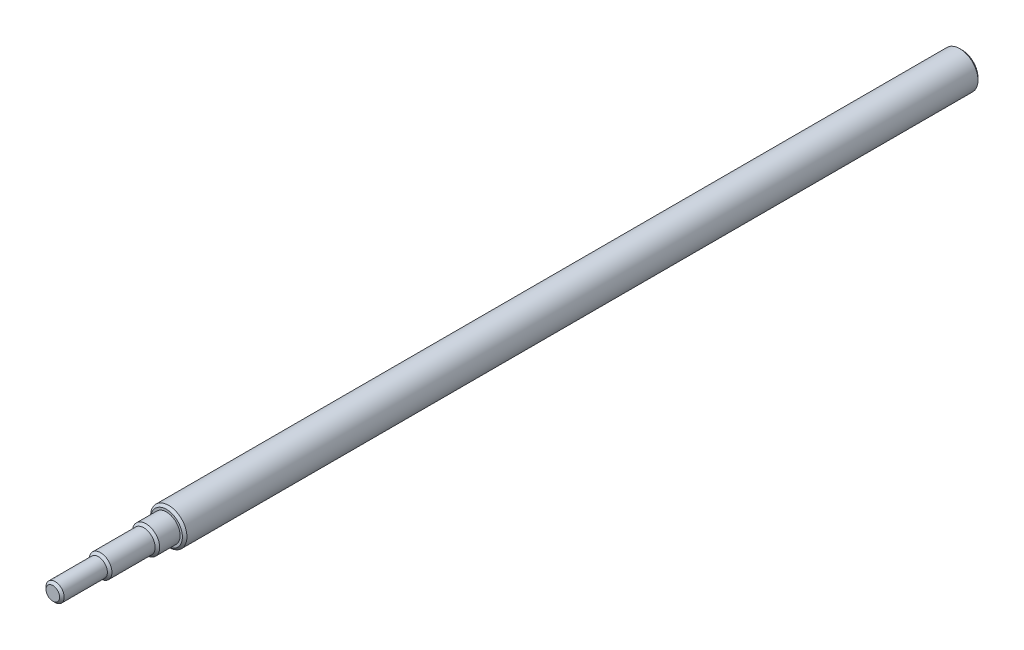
ISO-10303-21;
HEADER;
FILE_DESCRIPTION(('STEP AP214'),'2;1');
FILE_NAME('part.step','',(''),(''),'','','');
FILE_SCHEMA(('AUTOMOTIVE_DESIGN { 1 0 10303 214 1 1 1 1 }'));
ENDSEC;
DATA;
#1=APPLICATION_CONTEXT('core data for automotive mechanical design processes');
#2=APPLICATION_PROTOCOL_DEFINITION('international standard','automotive_design',2000,#1);
#3=PRODUCT_CONTEXT('',#1,'mechanical');
#4=PRODUCT('Part','Part','',(#3));
#5=PRODUCT_RELATED_PRODUCT_CATEGORY('part','',(#4));
#6=PRODUCT_DEFINITION_FORMATION('','',#4);
#7=PRODUCT_DEFINITION_CONTEXT('part definition',#1,'design');
#8=PRODUCT_DEFINITION('design','',#6,#7);
#9=PRODUCT_DEFINITION_SHAPE('','',#8);
#10=(LENGTH_UNIT() NAMED_UNIT(*) SI_UNIT(.MILLI.,.METRE.));
#11=(NAMED_UNIT(*) PLANE_ANGLE_UNIT() SI_UNIT($,.RADIAN.));
#12=(NAMED_UNIT(*) SI_UNIT($,.STERADIAN.) SOLID_ANGLE_UNIT());
#13=UNCERTAINTY_MEASURE_WITH_UNIT(LENGTH_MEASURE(1.E-05),#10,'distance_accuracy_value','');
#14=(GEOMETRIC_REPRESENTATION_CONTEXT(3) GLOBAL_UNCERTAINTY_ASSIGNED_CONTEXT((#13)) GLOBAL_UNIT_ASSIGNED_CONTEXT((#10,
#11,#12)) REPRESENTATION_CONTEXT('',''));
#15=CARTESIAN_POINT('',(0.,0.,0.));
#16=DIRECTION('',(0.,0.,1.));
#17=DIRECTION('',(1.,0.,0.));
#18=AXIS2_PLACEMENT_3D('',#15,#16,#17);
#19=CARTESIAN_POINT('',(0.,0.,350.));
#20=DIRECTION('',(0.,0.,-1.));
#21=DIRECTION('',(-1.,0.,0.));
#22=AXIS2_PLACEMENT_3D('',#19,#20,#21);
#23=CYLINDRICAL_SURFACE('',#22,8.);
#24=CARTESIAN_POINT('',(0.,0.,349.));
#25=DIRECTION('',(0.,0.,1.));
#26=DIRECTION('',(1.,0.,0.));
#27=AXIS2_PLACEMENT_3D('',#24,#25,#26);
#28=CIRCLE('',#27,8.);
#29=CARTESIAN_POINT('',(8.,0.,349.));
#30=VERTEX_POINT('',#29);
#31=EDGE_CURVE('E57',#30,#30,#28,.F.);
#32=ORIENTED_EDGE('',*,*,#31,.T.);
#33=EDGE_LOOP('',(#32));
#34=FACE_BOUND('',#33,.T.);
#35=CARTESIAN_POINT('',(0.,0.,0.999999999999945));
#36=DIRECTION('',(0.,0.,1.));
#37=DIRECTION('',(1.,0.,0.));
#38=AXIS2_PLACEMENT_3D('',#35,#36,#37);
#39=CIRCLE('',#38,8.);
#40=CARTESIAN_POINT('',(8.,0.,0.999999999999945));
#41=VERTEX_POINT('',#40);
#42=EDGE_CURVE('E66',#41,#41,#39,.T.);
#43=ORIENTED_EDGE('',*,*,#42,.T.);
#44=EDGE_LOOP('',(#43));
#45=FACE_BOUND('',#44,.T.);
#46=ADVANCED_FACE('F37',(#34,#45),#23,.T.);
#47=CARTESIAN_POINT('',(0.,0.,350.));
#48=DIRECTION('',(0.,0.,1.));
#49=DIRECTION('',(1.,0.,0.));
#50=AXIS2_PLACEMENT_3D('',#47,#48,#49);
#51=PLANE('',#50);
#52=CARTESIAN_POINT('',(0.,0.,350.));
#53=DIRECTION('',(0.,0.,1.));
#54=DIRECTION('',(1.,0.,0.));
#55=AXIS2_PLACEMENT_3D('',#52,#53,#54);
#56=CIRCLE('',#55,7.00000000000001);
#57=CARTESIAN_POINT('',(7.00000000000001,0.,350.));
#58=VERTEX_POINT('',#57);
#59=EDGE_CURVE('E60',#58,#58,#56,.T.);
#60=ORIENTED_EDGE('',*,*,#59,.T.);
#61=EDGE_LOOP('',(#60));
#62=FACE_BOUND('',#61,.T.);
#63=CARTESIAN_POINT('',(0.,0.,350.));
#64=DIRECTION('',(0.,0.,1.));
#65=DIRECTION('',(1.,0.,0.));
#66=AXIS2_PLACEMENT_3D('',#63,#64,#65);
#67=CIRCLE('',#66,6.);
#68=CARTESIAN_POINT('',(6.,0.,350.));
#69=VERTEX_POINT('',#68);
#70=EDGE_CURVE('E69',#69,#69,#67,.T.);
#71=ORIENTED_EDGE('',*,*,#70,.F.);
#72=EDGE_LOOP('',(#71));
#73=FACE_BOUND('',#72,.T.);
#74=ADVANCED_FACE('F94',(#62,#73),#51,.T.);
#75=CARTESIAN_POINT('',(0.,0.,0.));
#76=DIRECTION('',(0.,0.,1.));
#77=DIRECTION('',(1.,0.,0.));
#78=AXIS2_PLACEMENT_3D('',#75,#76,#77);
#79=PLANE('',#78);
#80=CARTESIAN_POINT('',(0.,0.,0.));
#81=DIRECTION('',(0.,0.,1.));
#82=DIRECTION('',(1.,0.,0.));
#83=AXIS2_PLACEMENT_3D('',#80,#81,#82);
#84=CIRCLE('',#83,7.00000000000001);
#85=CARTESIAN_POINT('',(7.00000000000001,0.,0.));
#86=VERTEX_POINT('',#85);
#87=EDGE_CURVE('E63',#86,#86,#84,.F.);
#88=ORIENTED_EDGE('',*,*,#87,.T.);
#89=EDGE_LOOP('',(#88));
#90=FACE_BOUND('',#89,.T.);
#91=ADVANCED_FACE('F100',(#90),#79,.F.);
#92=CARTESIAN_POINT('',(0.,0.,360.));
#93=DIRECTION('',(0.,0.,-1.));
#94=DIRECTION('',(-1.,0.,0.));
#95=AXIS2_PLACEMENT_3D('',#92,#93,#94);
#96=CYLINDRICAL_SURFACE('',#95,6.);
#97=CARTESIAN_POINT('',(0.,0.,359.));
#98=DIRECTION('',(0.,0.,1.));
#99=DIRECTION('',(1.,0.,0.));
#100=AXIS2_PLACEMENT_3D('',#97,#98,#99);
#101=CIRCLE('',#100,6.);
#102=CARTESIAN_POINT('',(6.,0.,359.));
#103=VERTEX_POINT('',#102);
#104=EDGE_CURVE('E10',#103,#103,#101,.F.);
#105=ORIENTED_EDGE('',*,*,#104,.T.);
#106=EDGE_LOOP('',(#105));
#107=FACE_BOUND('',#106,.T.);
#108=ORIENTED_EDGE('',*,*,#70,.T.);
#109=EDGE_LOOP('',(#108));
#110=FACE_BOUND('',#109,.T.);
#111=ADVANCED_FACE('F121',(#107,#110),#96,.T.);
#112=CARTESIAN_POINT('',(0.,0.,380.));
#113=DIRECTION('',(0.,0.,-1.));
#114=DIRECTION('',(-1.,0.,0.));
#115=AXIS2_PLACEMENT_3D('',#112,#113,#114);
#116=CYLINDRICAL_SURFACE('',#115,5.);
#117=CARTESIAN_POINT('',(0.,0.,379.));
#118=DIRECTION('',(0.,0.,1.));
#119=DIRECTION('',(1.,0.,0.));
#120=AXIS2_PLACEMENT_3D('',#117,#118,#119);
#121=CIRCLE('',#120,5.);
#122=CARTESIAN_POINT('',(5.,0.,379.));
#123=VERTEX_POINT('',#122);
#124=EDGE_CURVE('E44',#123,#123,#121,.F.);
#125=ORIENTED_EDGE('',*,*,#124,.T.);
#126=EDGE_LOOP('',(#125));
#127=FACE_BOUND('',#126,.T.);
#128=CARTESIAN_POINT('',(0.,0.,360.));
#129=DIRECTION('',(0.,0.,1.));
#130=DIRECTION('',(1.,0.,0.));
#131=AXIS2_PLACEMENT_3D('',#128,#129,#130);
#132=CIRCLE('',#131,5.);
#133=CARTESIAN_POINT('',(5.,0.,360.));
#134=VERTEX_POINT('',#133);
#135=EDGE_CURVE('E72',#134,#134,#132,.T.);
#136=ORIENTED_EDGE('',*,*,#135,.T.);
#137=EDGE_LOOP('',(#136));
#138=FACE_BOUND('',#137,.T.);
#139=ADVANCED_FACE('F123',(#127,#138),#116,.T.);
#140=CARTESIAN_POINT('',(0.,0.,400.));
#141=DIRECTION('',(0.,0.,-1.));
#142=DIRECTION('',(-1.,0.,0.));
#143=AXIS2_PLACEMENT_3D('',#140,#141,#142);
#144=CYLINDRICAL_SURFACE('',#143,4.);
#145=CARTESIAN_POINT('',(0.,0.,399.));
#146=DIRECTION('',(0.,0.,1.));
#147=DIRECTION('',(1.,0.,0.));
#148=AXIS2_PLACEMENT_3D('',#145,#146,#147);
#149=CIRCLE('',#148,4.);
#150=CARTESIAN_POINT('',(4.,0.,399.));
#151=VERTEX_POINT('',#150);
#152=EDGE_CURVE('E48',#151,#151,#149,.F.);
#153=ORIENTED_EDGE('',*,*,#152,.T.);
#154=EDGE_LOOP('',(#153));
#155=FACE_BOUND('',#154,.T.);
#156=CARTESIAN_POINT('',(0.,0.,380.));
#157=DIRECTION('',(0.,0.,1.));
#158=DIRECTION('',(1.,0.,0.));
#159=AXIS2_PLACEMENT_3D('',#156,#157,#158);
#160=CIRCLE('',#159,4.);
#161=CARTESIAN_POINT('',(4.,0.,380.));
#162=VERTEX_POINT('',#161);
#163=EDGE_CURVE('E75',#162,#162,#160,.T.);
#164=ORIENTED_EDGE('',*,*,#163,.T.);
#165=EDGE_LOOP('',(#164));
#166=FACE_BOUND('',#165,.T.);
#167=ADVANCED_FACE('F79',(#155,#166),#144,.T.);
#168=CARTESIAN_POINT('',(0.,0.,400.));
#169=DIRECTION('',(0.,0.,1.));
#170=DIRECTION('',(1.,0.,0.));
#171=AXIS2_PLACEMENT_3D('',#168,#169,#170);
#172=PLANE('',#171);
#173=CARTESIAN_POINT('',(0.,0.,400.));
#174=DIRECTION('',(0.,0.,1.));
#175=DIRECTION('',(1.,0.,0.));
#176=AXIS2_PLACEMENT_3D('',#173,#174,#175);
#177=CIRCLE('',#176,3.);
#178=CARTESIAN_POINT('',(3.,0.,400.));
#179=VERTEX_POINT('',#178);
#180=EDGE_CURVE('E52',#179,#179,#177,.T.);
#181=ORIENTED_EDGE('',*,*,#180,.T.);
#182=EDGE_LOOP('',(#181));
#183=FACE_BOUND('',#182,.T.);
#184=ADVANCED_FACE('F109',(#183),#172,.T.);
#185=CARTESIAN_POINT('',(0.,0.,0.999999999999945));
#186=DIRECTION('',(0.,0.,1.));
#187=DIRECTION('',(1.,0.,0.));
#188=AXIS2_PLACEMENT_3D('',#185,#186,#187);
#189=CONICAL_SURFACE('',#188,8.,0.785398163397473);
#190=ORIENTED_EDGE('',*,*,#87,.F.);
#191=EDGE_LOOP('',(#190));
#192=FACE_BOUND('',#191,.T.);
#193=ORIENTED_EDGE('',*,*,#42,.F.);
#194=EDGE_LOOP('',(#193));
#195=FACE_BOUND('',#194,.T.);
#196=ADVANCED_FACE('F106',(#192,#195),#189,.T.);
#197=CARTESIAN_POINT('',(0.,0.,350.));
#198=DIRECTION('',(0.,0.,-1.));
#199=DIRECTION('',(-1.,0.,0.));
#200=AXIS2_PLACEMENT_3D('',#197,#198,#199);
#201=CONICAL_SURFACE('',#200,7.00000000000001,0.785398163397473);
#202=ORIENTED_EDGE('',*,*,#31,.F.);
#203=EDGE_LOOP('',(#202));
#204=FACE_BOUND('',#203,.T.);
#205=ORIENTED_EDGE('',*,*,#59,.F.);
#206=EDGE_LOOP('',(#205));
#207=FACE_BOUND('',#206,.T.);
#208=ADVANCED_FACE('F90',(#204,#207),#201,.T.);
#209=CARTESIAN_POINT('',(0.,0.,400.));
#210=DIRECTION('',(0.,0.,-1.));
#211=DIRECTION('',(-1.,0.,0.));
#212=AXIS2_PLACEMENT_3D('',#209,#210,#211);
#213=CONICAL_SURFACE('',#212,3.,0.785398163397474);
#214=ORIENTED_EDGE('',*,*,#152,.F.);
#215=EDGE_LOOP('',(#214));
#216=FACE_BOUND('',#215,.T.);
#217=ORIENTED_EDGE('',*,*,#180,.F.);
#218=EDGE_LOOP('',(#217));
#219=FACE_BOUND('',#218,.T.);
#220=ADVANCED_FACE('F83',(#216,#219),#213,.T.);
#221=CARTESIAN_POINT('',(0.,0.,380.));
#222=DIRECTION('',(0.,0.,-1.));
#223=DIRECTION('',(-1.,0.,0.));
#224=AXIS2_PLACEMENT_3D('',#221,#222,#223);
#225=CONICAL_SURFACE('',#224,4.00000000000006,0.785398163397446);
#226=ORIENTED_EDGE('',*,*,#124,.F.);
#227=EDGE_LOOP('',(#226));
#228=FACE_BOUND('',#227,.T.);
#229=ORIENTED_EDGE('',*,*,#163,.F.);
#230=EDGE_LOOP('',(#229));
#231=FACE_BOUND('',#230,.T.);
#232=ADVANCED_FACE('F81',(#228,#231),#225,.T.);
#233=CARTESIAN_POINT('',(0.,0.,360.));
#234=DIRECTION('',(0.,0.,-1.));
#235=DIRECTION('',(-1.,0.,0.));
#236=AXIS2_PLACEMENT_3D('',#233,#234,#235);
#237=CONICAL_SURFACE('',#236,5.00000000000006,0.785398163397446);
#238=ORIENTED_EDGE('',*,*,#104,.F.);
#239=EDGE_LOOP('',(#238));
#240=FACE_BOUND('',#239,.T.);
#241=ORIENTED_EDGE('',*,*,#135,.F.);
#242=EDGE_LOOP('',(#241));
#243=FACE_BOUND('',#242,.T.);
#244=ADVANCED_FACE('F39',(#240,#243),#237,.T.);
#245=CLOSED_SHELL('',(#46,#74,#91,#111,#139,#167,#184,#196,#208,#220,#232,#244));
#246=MANIFOLD_SOLID_BREP('B2',#245);
#247=ADVANCED_BREP_SHAPE_REPRESENTATION('',(#18,#246),#14);
#248=SHAPE_DEFINITION_REPRESENTATION(#9,#247);
ENDSEC;
END-ISO-10303-21;
